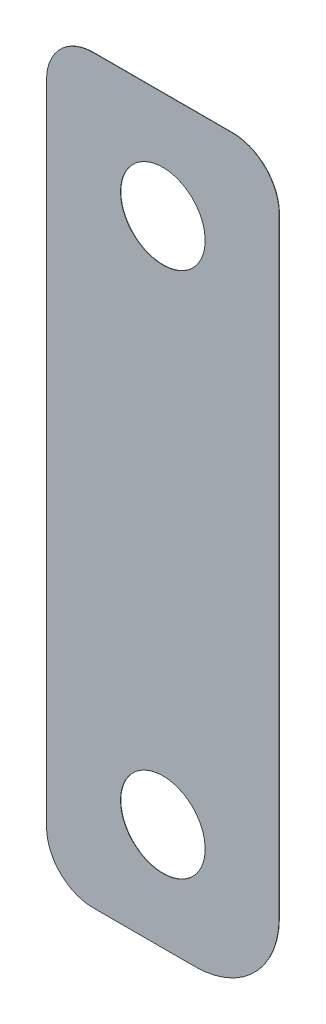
ISO-10303-21;
HEADER;
FILE_DESCRIPTION(('STEP AP214'),'2;1');
FILE_NAME('part.step','',(''),(''),'','','');
FILE_SCHEMA(('AUTOMOTIVE_DESIGN { 1 0 10303 214 1 1 1 1 }'));
ENDSEC;
DATA;
#1=APPLICATION_CONTEXT('core data for automotive mechanical design processes');
#2=APPLICATION_PROTOCOL_DEFINITION('international standard','automotive_design',2000,#1);
#3=PRODUCT_CONTEXT('',#1,'mechanical');
#4=PRODUCT('Part','Part','',(#3));
#5=PRODUCT_RELATED_PRODUCT_CATEGORY('part','',(#4));
#6=PRODUCT_DEFINITION_FORMATION('','',#4);
#7=PRODUCT_DEFINITION_CONTEXT('part definition',#1,'design');
#8=PRODUCT_DEFINITION('design','',#6,#7);
#9=PRODUCT_DEFINITION_SHAPE('','',#8);
#10=(LENGTH_UNIT() NAMED_UNIT(*) SI_UNIT(.MILLI.,.METRE.));
#11=(NAMED_UNIT(*) PLANE_ANGLE_UNIT() SI_UNIT($,.RADIAN.));
#12=(NAMED_UNIT(*) SI_UNIT($,.STERADIAN.) SOLID_ANGLE_UNIT());
#13=UNCERTAINTY_MEASURE_WITH_UNIT(LENGTH_MEASURE(1.E-05),#10,'distance_accuracy_value','');
#14=(GEOMETRIC_REPRESENTATION_CONTEXT(3) GLOBAL_UNCERTAINTY_ASSIGNED_CONTEXT((#13)) GLOBAL_UNIT_ASSIGNED_CONTEXT((#10,
#11,#12)) REPRESENTATION_CONTEXT('',''));
#15=CARTESIAN_POINT('',(0.,0.,0.));
#16=DIRECTION('',(0.,0.,1.));
#17=DIRECTION('',(1.,0.,0.));
#18=AXIS2_PLACEMENT_3D('',#15,#16,#17);
#19=CARTESIAN_POINT('',(-925.956545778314,-3.6454062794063,71.9582));
#20=DIRECTION('',(0.,0.,-1.));
#21=DIRECTION('',(-1.,0.,0.));
#22=AXIS2_PLACEMENT_3D('',#19,#20,#21);
#23=CYLINDRICAL_SURFACE('',#22,3.93700000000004);
#24=CARTESIAN_POINT('',(-925.956545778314,-3.6454062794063,71.9328));
#25=DIRECTION('',(0.,0.,-1.));
#26=DIRECTION('',(-1.,0.,0.));
#27=AXIS2_PLACEMENT_3D('',#24,#25,#26);
#28=CIRCLE('',#27,3.93700000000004);
#29=CARTESIAN_POINT('',(-929.893545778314,-3.64540627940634,71.9328));
#30=VERTEX_POINT('',#29);
#31=CARTESIAN_POINT('',(-925.956545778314,0.291593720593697,71.9328));
#32=VERTEX_POINT('',#31);
#33=EDGE_CURVE('E155',#30,#32,#28,.T.);
#34=ORIENTED_EDGE('',*,*,#33,.F.);
#35=DIRECTION('',(0.,0.,-1.));
#36=VECTOR('',#35,1.);
#37=CARTESIAN_POINT('',(-929.893545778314,-3.64540627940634,71.9582));
#38=LINE('',#37,#36);
#39=CARTESIAN_POINT('',(-929.893545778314,-3.64540627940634,71.9582));
#40=VERTEX_POINT('',#39);
#41=EDGE_CURVE('E11',#40,#30,#38,.T.);
#42=ORIENTED_EDGE('',*,*,#41,.F.);
#43=CARTESIAN_POINT('',(-925.956545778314,-3.6454062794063,71.9582));
#44=DIRECTION('',(0.,0.,-1.));
#45=DIRECTION('',(-1.,0.,0.));
#46=AXIS2_PLACEMENT_3D('',#43,#44,#45);
#47=CIRCLE('',#46,3.93700000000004);
#48=CARTESIAN_POINT('',(-925.956545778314,0.291593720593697,71.9582));
#49=VERTEX_POINT('',#48);
#50=EDGE_CURVE('E184',#40,#49,#47,.T.);
#51=ORIENTED_EDGE('',*,*,#50,.T.);
#52=DIRECTION('',(0.,0.,-1.));
#53=VECTOR('',#52,1.);
#54=CARTESIAN_POINT('',(-925.956545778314,0.291593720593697,71.9582));
#55=LINE('',#54,#53);
#56=EDGE_CURVE('E54',#49,#32,#55,.T.);
#57=ORIENTED_EDGE('',*,*,#56,.T.);
#58=EDGE_LOOP('',(#34,#42,#51,#57));
#59=FACE_BOUND('',#58,.T.);
#60=ADVANCED_FACE('F51',(#59),#23,.T.);
#61=CARTESIAN_POINT('',(-929.893545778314,-58.2554062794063,71.9582));
#62=DIRECTION('',(-1.,0.,0.));
#63=DIRECTION('',(0.,0.,1.));
#64=AXIS2_PLACEMENT_3D('',#61,#62,#63);
#65=PLANE('',#64);
#66=DIRECTION('',(0.,1.,0.));
#67=VECTOR('',#66,1.);
#68=CARTESIAN_POINT('',(-929.893545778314,-58.2554062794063,71.9328));
#69=LINE('',#68,#67);
#70=CARTESIAN_POINT('',(-929.893545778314,-58.2554062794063,71.9328));
#71=VERTEX_POINT('',#70);
#72=EDGE_CURVE('E181',#71,#30,#69,.T.);
#73=ORIENTED_EDGE('',*,*,#72,.F.);
#74=DIRECTION('',(0.,0.,-1.));
#75=VECTOR('',#74,1.);
#76=CARTESIAN_POINT('',(-929.893545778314,-58.2554062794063,71.9582));
#77=LINE('',#76,#75);
#78=CARTESIAN_POINT('',(-929.893545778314,-58.2554062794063,71.9582));
#79=VERTEX_POINT('',#78);
#80=EDGE_CURVE('E61',#79,#71,#77,.T.);
#81=ORIENTED_EDGE('',*,*,#80,.F.);
#82=DIRECTION('',(0.,1.,0.));
#83=VECTOR('',#82,1.);
#84=CARTESIAN_POINT('',(-929.893545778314,-58.2554062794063,71.9582));
#85=LINE('',#84,#83);
#86=EDGE_CURVE('E140',#79,#40,#85,.T.);
#87=ORIENTED_EDGE('',*,*,#86,.T.);
#88=ORIENTED_EDGE('',*,*,#41,.T.);
#89=EDGE_LOOP('',(#73,#81,#87,#88));
#90=FACE_BOUND('',#89,.T.);
#91=ADVANCED_FACE('F204',(#90),#65,.T.);
#92=CARTESIAN_POINT('',(-925.956545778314,-58.2554062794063,71.9582));
#93=DIRECTION('',(0.,0.,-1.));
#94=DIRECTION('',(-1.,0.,0.));
#95=AXIS2_PLACEMENT_3D('',#92,#93,#94);
#96=CYLINDRICAL_SURFACE('',#95,3.93700000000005);
#97=CARTESIAN_POINT('',(-925.956545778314,-58.2554062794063,71.9328));
#98=DIRECTION('',(0.,0.,-1.));
#99=DIRECTION('',(-1.,0.,0.));
#100=AXIS2_PLACEMENT_3D('',#97,#98,#99);
#101=CIRCLE('',#100,3.93700000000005);
#102=CARTESIAN_POINT('',(-925.956545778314,-62.1924062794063,71.9328));
#103=VERTEX_POINT('',#102);
#104=EDGE_CURVE('E126',#103,#71,#101,.T.);
#105=ORIENTED_EDGE('',*,*,#104,.F.);
#106=DIRECTION('',(0.,0.,-1.));
#107=VECTOR('',#106,1.);
#108=CARTESIAN_POINT('',(-925.956545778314,-62.1924062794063,71.9582));
#109=LINE('',#108,#107);
#110=CARTESIAN_POINT('',(-925.956545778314,-62.1924062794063,71.9582));
#111=VERTEX_POINT('',#110);
#112=EDGE_CURVE('E121',#111,#103,#109,.T.);
#113=ORIENTED_EDGE('',*,*,#112,.F.);
#114=CARTESIAN_POINT('',(-925.956545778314,-58.2554062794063,71.9582));
#115=DIRECTION('',(0.,0.,-1.));
#116=DIRECTION('',(-1.,0.,0.));
#117=AXIS2_PLACEMENT_3D('',#114,#115,#116);
#118=CIRCLE('',#117,3.93700000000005);
#119=EDGE_CURVE('E124',#111,#79,#118,.T.);
#120=ORIENTED_EDGE('',*,*,#119,.T.);
#121=ORIENTED_EDGE('',*,*,#80,.T.);
#122=EDGE_LOOP('',(#105,#113,#120,#121));
#123=FACE_BOUND('',#122,.T.);
#124=ADVANCED_FACE('F123',(#123),#96,.T.);
#125=CARTESIAN_POINT('',(-917.384045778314,-62.1924062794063,71.9582));
#126=DIRECTION('',(0.,-1.,0.));
#127=DIRECTION('',(1.,0.,0.));
#128=AXIS2_PLACEMENT_3D('',#125,#126,#127);
#129=PLANE('',#128);
#130=DIRECTION('',(-1.,0.,0.));
#131=VECTOR('',#130,1.);
#132=CARTESIAN_POINT('',(-917.384045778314,-62.1924062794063,71.9328));
#133=LINE('',#132,#131);
#134=CARTESIAN_POINT('',(-917.384045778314,-62.1924062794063,71.9328));
#135=VERTEX_POINT('',#134);
#136=EDGE_CURVE('E176',#135,#103,#133,.T.);
#137=ORIENTED_EDGE('',*,*,#136,.F.);
#138=DIRECTION('',(0.,0.,-1.));
#139=VECTOR('',#138,1.);
#140=CARTESIAN_POINT('',(-917.384045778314,-62.1924062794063,71.9582));
#141=LINE('',#140,#139);
#142=CARTESIAN_POINT('',(-917.384045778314,-62.1924062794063,71.9582));
#143=VERTEX_POINT('',#142);
#144=EDGE_CURVE('E132',#143,#135,#141,.T.);
#145=ORIENTED_EDGE('',*,*,#144,.F.);
#146=DIRECTION('',(-1.,0.,0.));
#147=VECTOR('',#146,1.);
#148=CARTESIAN_POINT('',(-917.384045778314,-62.1924062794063,71.9582));
#149=LINE('',#148,#147);
#150=EDGE_CURVE('E138',#143,#111,#149,.T.);
#151=ORIENTED_EDGE('',*,*,#150,.T.);
#152=ORIENTED_EDGE('',*,*,#112,.T.);
#153=EDGE_LOOP('',(#137,#145,#151,#152));
#154=FACE_BOUND('',#153,.T.);
#155=ADVANCED_FACE('F143',(#154),#129,.T.);
#156=CARTESIAN_POINT('',(-917.384045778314,-55.0804062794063,71.9582));
#157=DIRECTION('',(0.,0.,-1.));
#158=DIRECTION('',(-1.,0.,0.));
#159=AXIS2_PLACEMENT_3D('',#156,#157,#158);
#160=CYLINDRICAL_SURFACE('',#159,7.11199999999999);
#161=CARTESIAN_POINT('',(-917.384045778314,-55.0804062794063,71.9328));
#162=DIRECTION('',(0.,0.,-1.));
#163=DIRECTION('',(-1.,0.,0.));
#164=AXIS2_PLACEMENT_3D('',#161,#162,#163);
#165=CIRCLE('',#164,7.11199999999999);
#166=CARTESIAN_POINT('',(-910.272045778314,-55.0804062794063,71.9328));
#167=VERTEX_POINT('',#166);
#168=EDGE_CURVE('E172',#167,#135,#165,.T.);
#169=ORIENTED_EDGE('',*,*,#168,.F.);
#170=DIRECTION('',(0.,0.,-1.));
#171=VECTOR('',#170,1.);
#172=CARTESIAN_POINT('',(-910.272045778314,-55.0804062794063,71.9582));
#173=LINE('',#172,#171);
#174=CARTESIAN_POINT('',(-910.272045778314,-55.0804062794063,71.9582));
#175=VERTEX_POINT('',#174);
#176=EDGE_CURVE('E190',#175,#167,#173,.T.);
#177=ORIENTED_EDGE('',*,*,#176,.F.);
#178=CARTESIAN_POINT('',(-917.384045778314,-55.0804062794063,71.9582));
#179=DIRECTION('',(0.,0.,-1.));
#180=DIRECTION('',(-1.,0.,0.));
#181=AXIS2_PLACEMENT_3D('',#178,#179,#180);
#182=CIRCLE('',#181,7.11199999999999);
#183=EDGE_CURVE('E145',#175,#143,#182,.T.);
#184=ORIENTED_EDGE('',*,*,#183,.T.);
#185=ORIENTED_EDGE('',*,*,#144,.T.);
#186=EDGE_LOOP('',(#169,#177,#184,#185));
#187=FACE_BOUND('',#186,.T.);
#188=ADVANCED_FACE('F217',(#187),#160,.T.);
#189=CARTESIAN_POINT('',(-910.272045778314,-3.64540627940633,71.9582));
#190=DIRECTION('',(1.,0.,0.));
#191=DIRECTION('',(0.,1.,0.));
#192=AXIS2_PLACEMENT_3D('',#189,#190,#191);
#193=PLANE('',#192);
#194=DIRECTION('',(0.,-1.,0.));
#195=VECTOR('',#194,1.);
#196=CARTESIAN_POINT('',(-910.272045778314,-3.64540627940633,71.9328));
#197=LINE('',#196,#195);
#198=CARTESIAN_POINT('',(-910.272045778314,-3.64540627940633,71.9328));
#199=VERTEX_POINT('',#198);
#200=EDGE_CURVE('E168',#199,#167,#197,.T.);
#201=ORIENTED_EDGE('',*,*,#200,.F.);
#202=DIRECTION('',(0.,0.,-1.));
#203=VECTOR('',#202,1.);
#204=CARTESIAN_POINT('',(-910.272045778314,-3.64540627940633,71.9582));
#205=LINE('',#204,#203);
#206=CARTESIAN_POINT('',(-910.272045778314,-3.64540627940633,71.9582));
#207=VERTEX_POINT('',#206);
#208=EDGE_CURVE('E193',#207,#199,#205,.T.);
#209=ORIENTED_EDGE('',*,*,#208,.F.);
#210=DIRECTION('',(0.,-1.,0.));
#211=VECTOR('',#210,1.);
#212=CARTESIAN_POINT('',(-910.272045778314,-3.64540627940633,71.9582));
#213=LINE('',#212,#211);
#214=EDGE_CURVE('E149',#207,#175,#213,.T.);
#215=ORIENTED_EDGE('',*,*,#214,.T.);
#216=ORIENTED_EDGE('',*,*,#176,.T.);
#217=EDGE_LOOP('',(#201,#209,#215,#216));
#218=FACE_BOUND('',#217,.T.);
#219=ADVANCED_FACE('F220',(#218),#193,.T.);
#220=CARTESIAN_POINT('',(-914.209045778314,-3.6454062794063,71.9582));
#221=DIRECTION('',(0.,0.,-1.));
#222=DIRECTION('',(-1.,0.,0.));
#223=AXIS2_PLACEMENT_3D('',#220,#221,#222);
#224=CYLINDRICAL_SURFACE('',#223,3.93699999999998);
#225=CARTESIAN_POINT('',(-914.209045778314,-3.6454062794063,71.9328));
#226=DIRECTION('',(0.,0.,-1.));
#227=DIRECTION('',(-1.,0.,0.));
#228=AXIS2_PLACEMENT_3D('',#225,#226,#227);
#229=CIRCLE('',#228,3.93699999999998);
#230=CARTESIAN_POINT('',(-914.209045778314,0.291593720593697,71.9328));
#231=VERTEX_POINT('',#230);
#232=EDGE_CURVE('E164',#231,#199,#229,.T.);
#233=ORIENTED_EDGE('',*,*,#232,.F.);
#234=DIRECTION('',(0.,0.,-1.));
#235=VECTOR('',#234,1.);
#236=CARTESIAN_POINT('',(-914.209045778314,0.291593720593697,71.9582));
#237=LINE('',#236,#235);
#238=CARTESIAN_POINT('',(-914.209045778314,0.291593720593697,71.9582));
#239=VERTEX_POINT('',#238);
#240=EDGE_CURVE('E195',#239,#231,#237,.T.);
#241=ORIENTED_EDGE('',*,*,#240,.F.);
#242=CARTESIAN_POINT('',(-914.209045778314,-3.6454062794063,71.9582));
#243=DIRECTION('',(0.,0.,-1.));
#244=DIRECTION('',(-1.,0.,0.));
#245=AXIS2_PLACEMENT_3D('',#242,#243,#244);
#246=CIRCLE('',#245,3.93699999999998);
#247=EDGE_CURVE('E273',#239,#207,#246,.T.);
#248=ORIENTED_EDGE('',*,*,#247,.T.);
#249=ORIENTED_EDGE('',*,*,#208,.T.);
#250=EDGE_LOOP('',(#233,#241,#248,#249));
#251=FACE_BOUND('',#250,.T.);
#252=ADVANCED_FACE('F224',(#251),#224,.T.);
#253=CARTESIAN_POINT('',(-925.956545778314,0.291593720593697,71.9582));
#254=DIRECTION('',(0.,1.,0.));
#255=DIRECTION('',(0.,0.,1.));
#256=AXIS2_PLACEMENT_3D('',#253,#254,#255);
#257=PLANE('',#256);
#258=DIRECTION('',(1.,0.,0.));
#259=VECTOR('',#258,1.);
#260=CARTESIAN_POINT('',(-925.956545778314,0.291593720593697,71.9328));
#261=LINE('',#260,#259);
#262=EDGE_CURVE('E159',#32,#231,#261,.T.);
#263=ORIENTED_EDGE('',*,*,#262,.F.);
#264=ORIENTED_EDGE('',*,*,#56,.F.);
#265=DIRECTION('',(1.,0.,0.));
#266=VECTOR('',#265,1.);
#267=CARTESIAN_POINT('',(-925.956545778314,0.291593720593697,71.9582));
#268=LINE('',#267,#266);
#269=EDGE_CURVE('E270',#49,#239,#268,.T.);
#270=ORIENTED_EDGE('',*,*,#269,.T.);
#271=ORIENTED_EDGE('',*,*,#240,.T.);
#272=EDGE_LOOP('',(#263,#264,#270,#271));
#273=FACE_BOUND('',#272,.T.);
#274=ADVANCED_FACE('F201',(#273),#257,.T.);
#275=CARTESIAN_POINT('',(-925.956545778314,-3.6454062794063,71.9582));
#276=DIRECTION('',(0.,0.,-1.));
#277=DIRECTION('',(-1.,0.,0.));
#278=AXIS2_PLACEMENT_3D('',#275,#276,#277);
#279=PLANE('',#278);
#280=CARTESIAN_POINT('',(-920.082795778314,-8.72540627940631,71.9582));
#281=DIRECTION('',(0.,0.,-1.));
#282=DIRECTION('',(-1.,0.,0.));
#283=AXIS2_PLACEMENT_3D('',#280,#281,#282);
#284=CIRCLE('',#283,3.56869999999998);
#285=CARTESIAN_POINT('',(-923.651495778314,-8.72540627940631,71.9582));
#286=VERTEX_POINT('',#285);
#287=EDGE_CURVE('E251',#286,#286,#284,.T.);
#288=ORIENTED_EDGE('',*,*,#287,.T.);
#289=EDGE_LOOP('',(#288));
#290=FACE_BOUND('',#289,.T.);
#291=CARTESIAN_POINT('',(-920.082795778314,-53.1754062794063,71.9582));
#292=DIRECTION('',(0.,0.,-1.));
#293=DIRECTION('',(-1.,0.,0.));
#294=AXIS2_PLACEMENT_3D('',#291,#292,#293);
#295=CIRCLE('',#294,3.56869999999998);
#296=CARTESIAN_POINT('',(-923.651495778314,-53.1754062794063,71.9582));
#297=VERTEX_POINT('',#296);
#298=EDGE_CURVE('E256',#297,#297,#295,.T.);
#299=ORIENTED_EDGE('',*,*,#298,.T.);
#300=EDGE_LOOP('',(#299));
#301=FACE_BOUND('',#300,.T.);
#302=ORIENTED_EDGE('',*,*,#50,.F.);
#303=ORIENTED_EDGE('',*,*,#86,.F.);
#304=ORIENTED_EDGE('',*,*,#119,.F.);
#305=ORIENTED_EDGE('',*,*,#150,.F.);
#306=ORIENTED_EDGE('',*,*,#183,.F.);
#307=ORIENTED_EDGE('',*,*,#214,.F.);
#308=ORIENTED_EDGE('',*,*,#247,.F.);
#309=ORIENTED_EDGE('',*,*,#269,.F.);
#310=EDGE_LOOP('',(#302,#303,#304,#305,#306,#307,#308,#309));
#311=FACE_BOUND('',#310,.T.);
#312=ADVANCED_FACE('F136',(#290,#301,#311),#279,.F.);
#313=CARTESIAN_POINT('',(-925.956545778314,-3.6454062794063,71.9328));
#314=DIRECTION('',(0.,0.,-1.));
#315=DIRECTION('',(-1.,0.,0.));
#316=AXIS2_PLACEMENT_3D('',#313,#314,#315);
#317=PLANE('',#316);
#318=CARTESIAN_POINT('',(-920.082795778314,-8.72540627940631,71.9328));
#319=DIRECTION('',(0.,0.,-1.));
#320=DIRECTION('',(-1.,0.,0.));
#321=AXIS2_PLACEMENT_3D('',#318,#319,#320);
#322=CIRCLE('',#321,3.56869999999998);
#323=CARTESIAN_POINT('',(-923.651495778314,-8.72540627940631,71.9328));
#324=VERTEX_POINT('',#323);
#325=EDGE_CURVE('E254',#324,#324,#322,.T.);
#326=ORIENTED_EDGE('',*,*,#325,.F.);
#327=EDGE_LOOP('',(#326));
#328=FACE_BOUND('',#327,.T.);
#329=CARTESIAN_POINT('',(-920.082795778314,-53.1754062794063,71.9328));
#330=DIRECTION('',(0.,0.,-1.));
#331=DIRECTION('',(-1.,0.,0.));
#332=AXIS2_PLACEMENT_3D('',#329,#330,#331);
#333=CIRCLE('',#332,3.56869999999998);
#334=CARTESIAN_POINT('',(-923.651495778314,-53.1754062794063,71.9328));
#335=VERTEX_POINT('',#334);
#336=EDGE_CURVE('E160',#335,#335,#333,.T.);
#337=ORIENTED_EDGE('',*,*,#336,.F.);
#338=EDGE_LOOP('',(#337));
#339=FACE_BOUND('',#338,.T.);
#340=ORIENTED_EDGE('',*,*,#33,.T.);
#341=ORIENTED_EDGE('',*,*,#262,.T.);
#342=ORIENTED_EDGE('',*,*,#232,.T.);
#343=ORIENTED_EDGE('',*,*,#200,.T.);
#344=ORIENTED_EDGE('',*,*,#168,.T.);
#345=ORIENTED_EDGE('',*,*,#136,.T.);
#346=ORIENTED_EDGE('',*,*,#104,.T.);
#347=ORIENTED_EDGE('',*,*,#72,.T.);
#348=EDGE_LOOP('',(#340,#341,#342,#343,#344,#345,#346,#347));
#349=FACE_BOUND('',#348,.T.);
#350=ADVANCED_FACE('F203',(#328,#339,#349),#317,.T.);
#351=CARTESIAN_POINT('',(-920.082795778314,-53.1754062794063,71.9328));
#352=DIRECTION('',(0.,0.,-1.));
#353=DIRECTION('',(-1.,0.,0.));
#354=AXIS2_PLACEMENT_3D('',#351,#352,#353);
#355=CYLINDRICAL_SURFACE('',#354,3.56869999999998);
#356=ORIENTED_EDGE('',*,*,#298,.F.);
#357=EDGE_LOOP('',(#356));
#358=FACE_BOUND('',#357,.T.);
#359=ORIENTED_EDGE('',*,*,#336,.T.);
#360=EDGE_LOOP('',(#359));
#361=FACE_BOUND('',#360,.T.);
#362=ADVANCED_FACE('F236',(#358,#361),#355,.F.);
#363=CARTESIAN_POINT('',(-920.082795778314,-8.72540627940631,71.9328));
#364=DIRECTION('',(0.,0.,-1.));
#365=DIRECTION('',(-1.,0.,0.));
#366=AXIS2_PLACEMENT_3D('',#363,#364,#365);
#367=CYLINDRICAL_SURFACE('',#366,3.56869999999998);
#368=ORIENTED_EDGE('',*,*,#287,.F.);
#369=EDGE_LOOP('',(#368));
#370=FACE_BOUND('',#369,.T.);
#371=ORIENTED_EDGE('',*,*,#325,.T.);
#372=EDGE_LOOP('',(#371));
#373=FACE_BOUND('',#372,.T.);
#374=ADVANCED_FACE('F243',(#370,#373),#367,.F.);
#375=CLOSED_SHELL('',(#60,#91,#124,#155,#188,#219,#252,#274,#312,#350,#362,#374));
#376=MANIFOLD_SOLID_BREP('B2',#375);
#377=ADVANCED_BREP_SHAPE_REPRESENTATION('',(#18,#376),#14);
#378=SHAPE_DEFINITION_REPRESENTATION(#9,#377);
ENDSEC;
END-ISO-10303-21;
